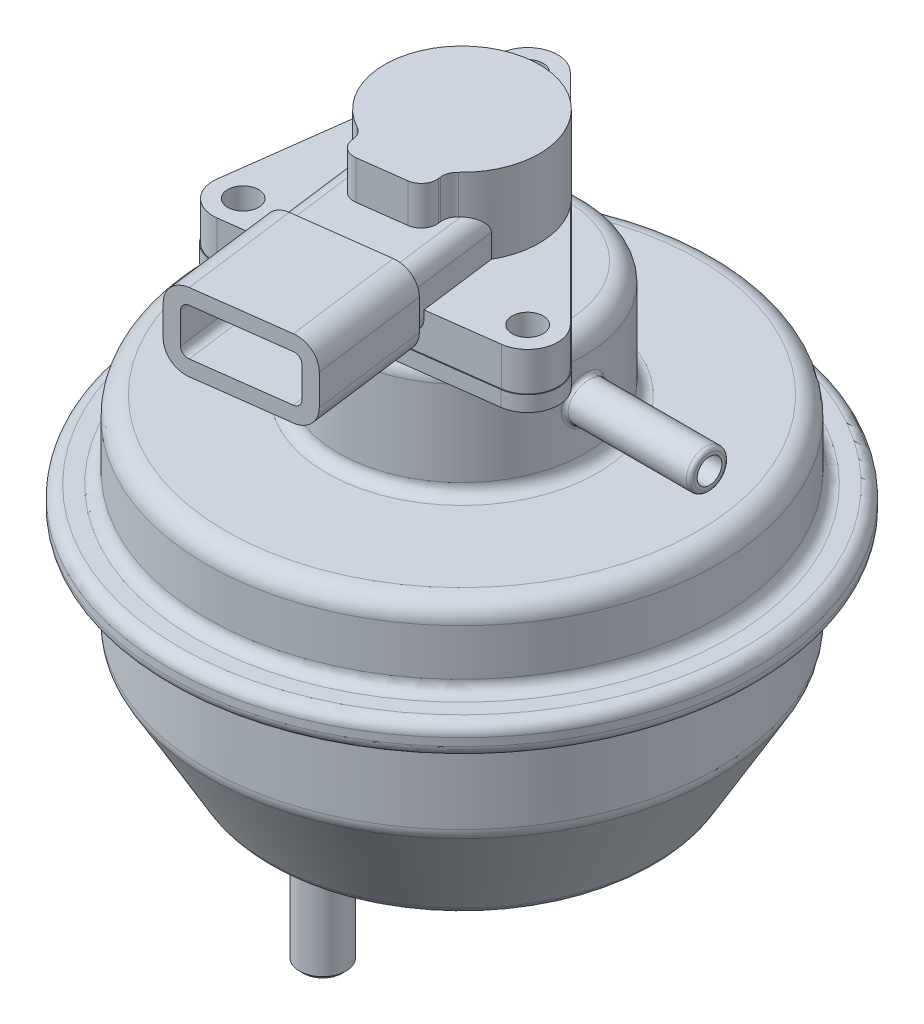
from build123d import *

# Parameters (mm, degrees)
CONG_1_R                     = 1.5
CONG_2_R                     = 2.5
ESQUISSE2_R                  = 5.5
ENL_V_MAT_EXTRU_1_DEPTH      = 1
ENL_V_MAT_EXTRU_2_REACH      = 84.807
ESQUISSE3_R                  = 3
EXTRUSION1_REACH             = 104.176
EXTRUSION1_END_RADIUS        = 16
ESQUISSE4_R                  = 2.5
ENL_V_MAT_EXTRU_3_REACH      = 104.176
ENL_V_MAT_EXTRU_3_END_RADIUS = 15
ESQUISSE5_R                  = 1.6
CONG_3_R                     = 0.5
ESQUISSE8_R                  = 3
EXTRUSION2_DEPTH             = 13.5
CHANFREIN1_SIZE              = 0.5
ESQUISSE9_R                  = 2
EXTRUSION3_DEPTH             = 2
ESQUISSE10_R                 = 2
EXTRUSION4_DEPTH             = 5
EXTRUSION5_DEPTH             = 10
CONG_4_R                     = 2
EXTRUSION6_REACH             = 107.257
ESQUISSE12_W                 = 16
ESQUISSE12_H                 = 8
EXTRUSION6_DIRECTION_2_DEPTH = 2
CONG_5_R                     = 2
EXTRUSION7_DEPTH             = 15
ESQUISSE14_W                 = 3
ESQUISSE14_H                 = 1
EXTRUSION8_DEPTH             = 10
CHANFREIN2_SIZE              = 0.25


with BuildPart() as part:
    # Esquisse1 → R_volution1 (revolve)
    with BuildSketch(Plane.XY, mode=Mode.PRIVATE) as r_volution1_sk:
        Polygon((0, 0), (9, 0), (9, 8), (24.339745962, 8), (33, 23), (33, 37), (35, 37), (35, 35), (38, 35), (38, 39), (33, 39), (33, 49), (16, 49), (16, 64), (0, 64), (0, 63), (15, 63), (15, 48), (32, 48), (32, 23.267949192), (23.762395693, 9), (0, 9), align=None)
    revolve(r_volution1_sk.sketch.rotate(Axis((0, -17.063066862, 0), (0, 1, 0)), 90), axis=Axis((0, -17.063066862, 0), (0, 1, 0)))

    # Cong_1
    cong_1_edges = [part.edges().sort_by_distance(p)[0] for p in [
        (0, 9, 23.762395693),
        (0, 23.267949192, 32),
        (0, 48, 32),
        (0, 63, 15),
        (0, 49, 16),
        (0, 39, 33),
        (0, 39, 38),
        (0, 35, 38),
        (0, 37, 33),
        (0, 8, 9),
    ]]
    fillet(cong_1_edges, radius=CONG_1_R)

    # Cong_2
    cong_2_edges = [part.edges().sort_by_distance(p)[0] for p in [
        (0, 48, 15),
        (0, 64, 16),
        (0, 49, 33),
        (0, 23, 33),
        (0, 8, 24.339745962),
        (0, 0, 9),
    ]]
    fillet(cong_2_edges, radius=CONG_2_R)

    # Esquisse2 → Enl_v. mat.-Extru.1 (cut)
    with BuildSketch(Plane.XZ):
        with Locations(Location((0, 0, 0), (0, 0, 270))):
            Circle(ESQUISSE2_R)
    extrude(amount=-ENL_V_MAT_EXTRU_1_DEPTH, mode=Mode.SUBTRACT)

    # Esquisse3 → Enl_v. mat.-Extru.2 (cut, up to next)
    with BuildSketch(Plane.XZ.offset(-1), mode=Mode.PRIVATE) as enl_v_mat_extru_2_sk1:
        with Locations(Location((0, 0, 0), (0, 0, 270))):
            Circle(ESQUISSE3_R)
    enl_v_mat_extru_2_tool1 = extrude(enl_v_mat_extru_2_sk1.sketch, amount=-ENL_V_MAT_EXTRU_2_REACH, mode=Mode.PRIVATE) & part.part
    add(enl_v_mat_extru_2_tool1.solids().sort_by_distance((0, 1, 0))[0], mode=Mode.SUBTRACT)

    # Extrusion1: up to this cylinder (the profile starts outside it)
    extrusion1_end = Plane(origin=(0, 56.5, 0), z_dir=(0, -1, 0)) * Cylinder(EXTRUSION1_END_RADIUS, 241.352, mode=Mode.PRIVATE)
    # Esquisse4 → Extrusion1 (add, up to the surface)
    with BuildSketch(Plane(origin=(32, 0, 0), x_dir=(0, 0, -1), z_dir=(1, 0, 0)), mode=Mode.PRIVATE) as extrusion1_sk1:
        with Locations((0, 56.5)):
            Circle(ESQUISSE4_R)
    extrusion1_tool1 = extrude(extrusion1_sk1.sketch, amount=-EXTRUSION1_REACH, mode=Mode.PRIVATE) - extrusion1_end
    add(extrusion1_tool1.solids().sort_by_distance((32, 56.5, 0))[0])

    # Enl_v. mat.-Extru.3: up to this cylinder (the profile starts outside it)
    enl_v_mat_extru_3_end = Plane(origin=(0, 56.5, 0), z_dir=(0, -1, 0)) * Cylinder(ENL_V_MAT_EXTRU_3_END_RADIUS, 239.352, mode=Mode.PRIVATE)
    # Esquisse5 → Enl_v. mat.-Extru.3 (cut, up to the surface)
    with BuildSketch(Plane(origin=(32, 0, 0), x_dir=(0, 0, -1), z_dir=(1, 0, 0)), mode=Mode.PRIVATE) as enl_v_mat_extru_3_sk1:
        with Locations((0, 56.5)):
            Circle(ESQUISSE5_R)
    enl_v_mat_extru_3_tool1 = extrude(enl_v_mat_extru_3_sk1.sketch, amount=-ENL_V_MAT_EXTRU_3_REACH, mode=Mode.PRIVATE) - enl_v_mat_extru_3_end
    add(enl_v_mat_extru_3_tool1.solids().sort_by_distance((32, 56.5, 0))[0], mode=Mode.SUBTRACT)

    # Cong_3
    cong_3_edges = [part.edges().sort_by_distance(p)[0] for p in [
        (15.803480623, 56.499999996, 2.500000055),
        (32, 56.5, 2.5),
    ]]
    fillet(cong_3_edges, radius=CONG_3_R)

    # Esquisse7 → Enl_vement de mati_re-R_volution1 (revolve, cut)
    with BuildSketch(Plane(origin=(0, 0, 0), x_dir=(0, 0, -1), z_dir=(1, 0, 0)), mode=Mode.PRIVATE) as enl_vement_de_mati_re_r_volution1_sk:
        Polygon((24.628421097, 14.5), (25.878421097, 16.665063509), (31.074573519, 13.665063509), (29.824573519, 11.5), align=None)
    revolve(enl_vement_de_mati_re_r_volution1_sk.sketch.rotate(Axis((0, 25.209039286, -6.079820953), (0, -0.49999999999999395, -0.8660254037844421)), 179.999999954), axis=Axis((0, 25.209039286, -6.079820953), (0, -0.49999999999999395, -0.8660254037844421)), mode=Mode.SUBTRACT)

    # Esquisse8 → Extrusion2 (add)
    with BuildSketch(Plane.XZ.offset(-8)):
        with Locations(Location((0, 18, 0), (0, 0, 270))):
            Circle(ESQUISSE8_R)
        with Locations(Location((0, -18, 0), (0, 0, 270))):
            Circle(ESQUISSE8_R)
    extrude(amount=EXTRUSION2_DEPTH)

    # Chanfrein1
    chanfrein1_edges = [part.edges().sort_by_distance(p)[0] for p in [
        (0, -5.5, 21),
        (0, -5.5, -15),
    ]]
    chamfer(chanfrein1_edges, length=CHANFREIN1_SIZE)

    # Esquisse9 → Extrusion3 (add)
    with BuildSketch(Plane(origin=(0, 64, 0), x_dir=(-1, 0, 0), z_dir=(0, 1, 0))):
        with BuildLine():
            Line((7.071067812, -21.213203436), (-21.213203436, 7.071067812))
            ThreePointArc((-21.213203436, 7.071067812), (-22.171726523, 11.187519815), (-18.902133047, 13.865896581))
            Line((-18.902133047, 13.865896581), (13.624778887, 18.108537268))
            ThreePointArc((13.624778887, 18.108537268), (16.970562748, 16.970562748), (18.108537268, 13.624778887))
            Line((18.108537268, 13.624778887), (13.865896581, -18.902133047))
            ThreePointArc((13.865896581, -18.902133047), (11.187519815, -22.171726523), (7.071067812, -21.213203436))
        make_face()
        with Locations(Location((-18.384776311, 9.899494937, 0), (0, 0, 90))):
            Circle(ESQUISSE9_R, mode=Mode.SUBTRACT)
        with Locations(Location((14.142135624, 14.142135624, 0), (0, 0, 90))):
            Circle(ESQUISSE9_R, mode=Mode.SUBTRACT)
        with Locations(Location((9.899494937, -18.384776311, 0), (0, 0, 90))):
            Circle(ESQUISSE9_R, mode=Mode.SUBTRACT)
    extrude(amount=EXTRUSION3_DEPTH)

    # Esquisse10 → Extrusion4 (add)
    with BuildSketch(Plane(origin=(0, 66, 0), x_dir=(-1, 0, 0), z_dir=(0, 1, 0))):
        with BuildLine():
            Line((-21.142492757, 7.14177849), (7.14177849, -21.142492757))
            ThreePointArc((7.14177849, -21.142492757), (11.155319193, -22.077052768), (13.76673654, -18.889199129))
            Line((13.76673654, -18.889199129), (18.009377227, 13.637712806))
            ThreePointArc((18.009377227, 13.637712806), (16.89985207, 16.89985207), (13.637712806, 18.009377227))
            Line((13.637712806, 18.009377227), (-18.889199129, 13.76673654))
            ThreePointArc((-18.889199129, 13.76673654), (-22.077052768, 11.155319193), (-21.142492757, 7.14177849))
        make_face()
        with Locations(Location((14.142135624, 14.142135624, 0), (0, 0, 90))):
            Circle(ESQUISSE10_R, mode=Mode.SUBTRACT)
        with Locations(Location((-18.384776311, 9.899494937, 0), (0, 0, 90))):
            Circle(ESQUISSE10_R, mode=Mode.SUBTRACT)
        with Locations(Location((9.899494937, -18.384776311, 0), (0, 0, 90))):
            Circle(ESQUISSE10_R, mode=Mode.SUBTRACT)
    extrude(amount=EXTRUSION4_DEPTH)

    # Esquisse11 → Extrusion5 (add)
    with BuildSketch(Plane(origin=(0, 71, 0), x_dir=(-1, 0, 0), z_dir=(0, 1, 0))):
        with BuildLine():
            Line((-6.078112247, 7.940815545), (-6.510072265, 11.252509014))
            Line((-6.510072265, 11.252509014), (3.405931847, 12.545900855))
            Line((3.405931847, 12.545900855), (3.837891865, 9.234207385))
            ThreePointArc((3.837891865, 9.234207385), (1.293391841, -9.916004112), (-6.078112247, 7.940815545))
        make_face()
    extrude(amount=EXTRUSION5_DEPTH)

    # Cong_4
    cong_4_edges = [part.edges().sort_by_distance(p)[0] for p in [
        (6.078112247, 76, 7.940815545),
        (-3.837891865, 76, 9.234207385),
        (-3.405931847, 76, 12.545900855),
        (6.510072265, 76, 11.252509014),
    ]]
    fillet(cong_4_edges, radius=CONG_4_R)

    # Esquisse12 → Extrusion6 (add, up to next)
    with BuildSketch(Plane(origin=(2.081612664, 0, 15.959030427), x_dir=(0.991600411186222, 0, -0.12933918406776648), z_dir=(0.12933918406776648, 0, 0.991600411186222)), mode=Mode.PRIVATE) as extrusion6_sk1:
        with Locations((0, 72)):
            Rectangle(ESQUISSE12_W, ESQUISSE12_H)
    extrusion6_tool1 = extrude(extrusion6_sk1.sketch, amount=-EXTRUSION6_REACH, mode=Mode.PRIVATE) - part.part
    add(extrusion6_tool1.solids().sort_by_distance((2.081613, 72, 15.95903))[0])

    # Esquisse12 → Extrusion6 direction 2 (add)
    with BuildSketch(Plane(origin=(2.081612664, 0, 15.959030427), x_dir=(0.991600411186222, 0, -0.12933918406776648), z_dir=(0.12933918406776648, 0, 0.991600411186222))):
        with Locations((0, 72)):
            Rectangle(ESQUISSE12_W, ESQUISSE12_H)
    extrude(amount=EXTRUSION6_DIRECTION_2_DEPTH)

    # Cong_5
    cong_5_edges = [part.edges().sort_by_distance(p)[0] for p in [
        (-6.374640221, 76, 12.980630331),
        (-5.721851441, 68, 17.985344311),
        (10.143755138, 68, 15.915917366),
        (9.490966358, 76, 10.911203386),
    ]]
    fillet(cong_5_edges, radius=CONG_5_R)

    # Esquisse13 → Extrusion7 (add)
    with BuildSketch(Plane(origin=(2.340291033, 0, 17.942231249), x_dir=(0.991600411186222, 0, -0.12933918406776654), z_dir=(0.12933918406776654, 0, 0.991600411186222))):
        with BuildLine():
            Line((6, 77), (-6, 77))
            ThreePointArc((-6, 77), (-8.121320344, 76.121320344), (-9, 74))
            Line((-9, 74), (-9, 70))
            ThreePointArc((-9, 70), (-8.121320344, 67.878679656), (-6, 67))
            Line((-6, 67), (6, 67))
            ThreePointArc((6, 67), (8.121320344, 67.878679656), (9, 70))
            Line((9, 70), (9, 74))
            ThreePointArc((9, 74), (8.121320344, 76.121320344), (6, 77))
        make_face()
        with BuildLine():
            Line((-7, 74), (-7, 70))
            ThreePointArc((-7, 70), (-6.707106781, 69.292893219), (-6, 69))
            Line((-6, 69), (6, 69))
            ThreePointArc((6, 69), (6.707106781, 69.292893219), (7, 70))
            Line((7, 70), (7, 74))
            ThreePointArc((7, 74), (6.707106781, 74.707106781), (6, 75))
            Line((6, 75), (-6, 75))
            ThreePointArc((-6, 75), (-6.707106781, 74.707106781), (-7, 74))
        make_face(mode=Mode.SUBTRACT)
    extrude(amount=EXTRUSION7_DEPTH)

    # Esquisse14 → Extrusion8 (add)
    with BuildSketch(Plane(origin=(2.340291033, 0, 17.942231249), x_dir=(0.991600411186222, 0, -0.12933918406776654), z_dir=(0.12933918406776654, 0, 0.991600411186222))):
        with Locations((0, 72)):
            Rectangle(ESQUISSE14_W, ESQUISSE14_H)
        with Locations((-4.5, 72)):
            Rectangle(ESQUISSE14_W, ESQUISSE14_H)
        with Locations((4.5, 72)):
            Rectangle(ESQUISSE14_W, ESQUISSE14_H)
    extrude(amount=EXTRUSION8_DEPTH)

    # Chanfrein2
    chanfrein2_edges = [part.edges().sort_by_distance(p)[0] for p in [
        (2.146282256, 72, 28.052244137),
        (3.633682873, 71.5, 27.858235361),
        (5.12108349, 72, 27.664226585),
        (3.633682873, 72.5, 27.858235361),
        (-2.315919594, 72, 28.634270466),
        (-0.828518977, 71.5, 28.440261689),
        (0.65888164, 72, 28.246252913),
        (-0.828518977, 72.5, 28.440261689),
        (6.608484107, 72, 27.470217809),
        (8.095884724, 71.5, 27.276209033),
        (9.58328534, 72, 27.082200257),
        (8.095884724, 72.5, 27.276209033),
    ]]
    chamfer(chanfrein2_edges, length=CHANFREIN2_SIZE)


solid = part.part
